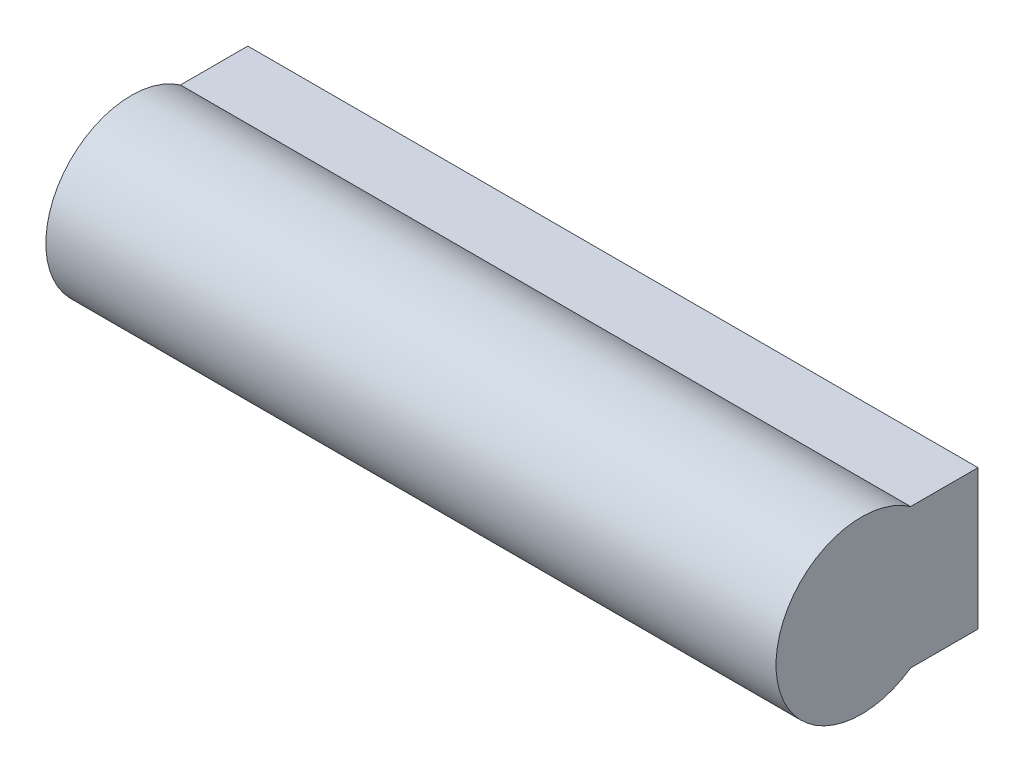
ISO-10303-21;
HEADER;
FILE_DESCRIPTION(('STEP AP214'),'2;1');
FILE_NAME('part.step','',(''),(''),'','','');
FILE_SCHEMA(('AUTOMOTIVE_DESIGN { 1 0 10303 214 1 1 1 1 }'));
ENDSEC;
DATA;
#1=APPLICATION_CONTEXT('core data for automotive mechanical design processes');
#2=APPLICATION_PROTOCOL_DEFINITION('international standard','automotive_design',2000,#1);
#3=PRODUCT_CONTEXT('',#1,'mechanical');
#4=PRODUCT('Part','Part','',(#3));
#5=PRODUCT_RELATED_PRODUCT_CATEGORY('part','',(#4));
#6=PRODUCT_DEFINITION_FORMATION('','',#4);
#7=PRODUCT_DEFINITION_CONTEXT('part definition',#1,'design');
#8=PRODUCT_DEFINITION('design','',#6,#7);
#9=PRODUCT_DEFINITION_SHAPE('','',#8);
#10=(LENGTH_UNIT() NAMED_UNIT(*) SI_UNIT(.MILLI.,.METRE.));
#11=(NAMED_UNIT(*) PLANE_ANGLE_UNIT() SI_UNIT($,.RADIAN.));
#12=(NAMED_UNIT(*) SI_UNIT($,.STERADIAN.) SOLID_ANGLE_UNIT());
#13=UNCERTAINTY_MEASURE_WITH_UNIT(LENGTH_MEASURE(1.E-05),#10,'distance_accuracy_value','');
#14=(GEOMETRIC_REPRESENTATION_CONTEXT(3) GLOBAL_UNCERTAINTY_ASSIGNED_CONTEXT((#13)) GLOBAL_UNIT_ASSIGNED_CONTEXT((#10,
#11,#12)) REPRESENTATION_CONTEXT('',''));
#15=CARTESIAN_POINT('',(0.,0.,0.));
#16=DIRECTION('',(0.,0.,1.));
#17=DIRECTION('',(1.,0.,0.));
#18=AXIS2_PLACEMENT_3D('',#15,#16,#17);
#19=CARTESIAN_POINT('',(37.5,0.,7.5));
#20=DIRECTION('',(-1.,0.,0.));
#21=DIRECTION('',(0.,0.,1.));
#22=AXIS2_PLACEMENT_3D('',#19,#20,#21);
#23=CYLINDRICAL_SURFACE('',#22,5.5);
#24=DIRECTION('',(-1.,0.,0.));
#25=VECTOR('',#24,1.);
#26=CARTESIAN_POINT('',(37.5,-4.5,4.33772233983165));
#27=LINE('',#26,#25);
#28=CARTESIAN_POINT('',(37.5,-4.5,4.33772233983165));
#29=VERTEX_POINT('',#28);
#30=CARTESIAN_POINT('',(-9.5,-4.5,4.33772233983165));
#31=VERTEX_POINT('',#30);
#32=EDGE_CURVE('E68',#29,#31,#27,.T.);
#33=ORIENTED_EDGE('',*,*,#32,.F.);
#34=CARTESIAN_POINT('',(37.5,0.,7.5));
#35=DIRECTION('',(1.,0.,0.));
#36=DIRECTION('',(0.,0.,-1.));
#37=AXIS2_PLACEMENT_3D('',#34,#35,#36);
#38=CIRCLE('',#37,5.5);
#39=CARTESIAN_POINT('',(37.5,4.5,4.33772233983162));
#40=VERTEX_POINT('',#39);
#41=EDGE_CURVE('E96',#40,#29,#38,.T.);
#42=ORIENTED_EDGE('',*,*,#41,.F.);
#43=DIRECTION('',(-1.,0.,0.));
#44=VECTOR('',#43,1.);
#45=CARTESIAN_POINT('',(37.5,4.5,4.33772233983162));
#46=LINE('',#45,#44);
#47=CARTESIAN_POINT('',(-9.5,4.5,4.33772233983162));
#48=VERTEX_POINT('',#47);
#49=EDGE_CURVE('E108',#40,#48,#46,.T.);
#50=ORIENTED_EDGE('',*,*,#49,.T.);
#51=CARTESIAN_POINT('',(-9.5,0.,7.5));
#52=DIRECTION('',(1.,0.,0.));
#53=DIRECTION('',(0.,0.,-1.));
#54=AXIS2_PLACEMENT_3D('',#51,#52,#53);
#55=CIRCLE('',#54,5.5);
#56=EDGE_CURVE('E79',#48,#31,#55,.T.);
#57=ORIENTED_EDGE('',*,*,#56,.T.);
#58=EDGE_LOOP('',(#33,#42,#50,#57));
#59=FACE_BOUND('',#58,.T.);
#60=ADVANCED_FACE('F14',(#59),#23,.T.);
#61=CARTESIAN_POINT('',(37.5,-4.5,4.33772233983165));
#62=DIRECTION('',(0.,1.,0.));
#63=DIRECTION('',(0.,0.,1.));
#64=AXIS2_PLACEMENT_3D('',#61,#62,#63);
#65=PLANE('',#64);
#66=DIRECTION('',(-1.,0.,0.));
#67=VECTOR('',#66,1.);
#68=CARTESIAN_POINT('',(37.5,-4.5,0.));
#69=LINE('',#68,#67);
#70=CARTESIAN_POINT('',(37.5,-4.5,0.));
#71=VERTEX_POINT('',#70);
#72=CARTESIAN_POINT('',(-9.5,-4.5,0.));
#73=VERTEX_POINT('',#72);
#74=EDGE_CURVE('E112',#71,#73,#69,.T.);
#75=ORIENTED_EDGE('',*,*,#74,.F.);
#76=DIRECTION('',(0.,0.,-1.));
#77=VECTOR('',#76,1.);
#78=CARTESIAN_POINT('',(37.5,-4.5,4.33772233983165));
#79=LINE('',#78,#77);
#80=EDGE_CURVE('E99',#29,#71,#79,.T.);
#81=ORIENTED_EDGE('',*,*,#80,.F.);
#82=ORIENTED_EDGE('',*,*,#32,.T.);
#83=DIRECTION('',(0.,0.,-1.));
#84=VECTOR('',#83,1.);
#85=CARTESIAN_POINT('',(-9.5,-4.5,4.33772233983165));
#86=LINE('',#85,#84);
#87=EDGE_CURVE('E87',#31,#73,#86,.T.);
#88=ORIENTED_EDGE('',*,*,#87,.T.);
#89=EDGE_LOOP('',(#75,#81,#82,#88));
#90=FACE_BOUND('',#89,.T.);
#91=ADVANCED_FACE('F16',(#90),#65,.F.);
#92=CARTESIAN_POINT('',(37.5,4.5,0.));
#93=DIRECTION('',(0.,0.,-1.));
#94=DIRECTION('',(0.,1.,0.));
#95=AXIS2_PLACEMENT_3D('',#92,#93,#94);
#96=PLANE('',#95);
#97=CARTESIAN_POINT('',(30.,0.,0.));
#98=DIRECTION('',(0.,0.,-1.));
#99=DIRECTION('',(0.,1.,0.));
#100=AXIS2_PLACEMENT_3D('',#97,#98,#99);
#101=CIRCLE('',#100,2.5);
#102=CARTESIAN_POINT('',(30.,2.5,0.));
#103=VERTEX_POINT('',#102);
#104=EDGE_CURVE('E81',#103,#103,#101,.T.);
#105=ORIENTED_EDGE('',*,*,#104,.F.);
#106=EDGE_LOOP('',(#105));
#107=FACE_BOUND('',#106,.T.);
#108=CARTESIAN_POINT('',(0.,0.,0.));
#109=DIRECTION('',(0.,0.,-1.));
#110=DIRECTION('',(0.,1.,0.));
#111=AXIS2_PLACEMENT_3D('',#108,#109,#110);
#112=CIRCLE('',#111,2.5);
#113=CARTESIAN_POINT('',(0.,2.5,0.));
#114=VERTEX_POINT('',#113);
#115=EDGE_CURVE('E76',#114,#114,#112,.T.);
#116=ORIENTED_EDGE('',*,*,#115,.F.);
#117=EDGE_LOOP('',(#116));
#118=FACE_BOUND('',#117,.T.);
#119=DIRECTION('',(-1.,0.,0.));
#120=VECTOR('',#119,1.);
#121=CARTESIAN_POINT('',(37.5,4.5,0.));
#122=LINE('',#121,#120);
#123=CARTESIAN_POINT('',(37.5,4.5,0.));
#124=VERTEX_POINT('',#123);
#125=CARTESIAN_POINT('',(-9.5,4.5,0.));
#126=VERTEX_POINT('',#125);
#127=EDGE_CURVE('E110',#124,#126,#122,.T.);
#128=ORIENTED_EDGE('',*,*,#127,.F.);
#129=DIRECTION('',(0.,-1.,0.));
#130=VECTOR('',#129,1.);
#131=CARTESIAN_POINT('',(37.5,4.5,0.));
#132=LINE('',#131,#130);
#133=EDGE_CURVE('E102',#124,#71,#132,.T.);
#134=ORIENTED_EDGE('',*,*,#133,.T.);
#135=ORIENTED_EDGE('',*,*,#74,.T.);
#136=DIRECTION('',(0.,-1.,0.));
#137=VECTOR('',#136,1.);
#138=CARTESIAN_POINT('',(-9.5,4.5,0.));
#139=LINE('',#138,#137);
#140=EDGE_CURVE('E90',#126,#73,#139,.T.);
#141=ORIENTED_EDGE('',*,*,#140,.F.);
#142=EDGE_LOOP('',(#128,#134,#135,#141));
#143=FACE_BOUND('',#142,.T.);
#144=ADVANCED_FACE('F125',(#107,#118,#143),#96,.T.);
#145=CARTESIAN_POINT('',(37.5,4.5,4.33772233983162));
#146=DIRECTION('',(0.,1.,0.));
#147=DIRECTION('',(1.,0.,0.));
#148=AXIS2_PLACEMENT_3D('',#145,#146,#147);
#149=PLANE('',#148);
#150=DIRECTION('',(0.,0.,-1.));
#151=VECTOR('',#150,1.);
#152=CARTESIAN_POINT('',(37.5,4.5,4.33772233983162));
#153=LINE('',#152,#151);
#154=EDGE_CURVE('E105',#40,#124,#153,.T.);
#155=ORIENTED_EDGE('',*,*,#154,.T.);
#156=ORIENTED_EDGE('',*,*,#127,.T.);
#157=DIRECTION('',(0.,0.,-1.));
#158=VECTOR('',#157,1.);
#159=CARTESIAN_POINT('',(-9.5,4.5,4.33772233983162));
#160=LINE('',#159,#158);
#161=EDGE_CURVE('E93',#48,#126,#160,.T.);
#162=ORIENTED_EDGE('',*,*,#161,.F.);
#163=ORIENTED_EDGE('',*,*,#49,.F.);
#164=EDGE_LOOP('',(#155,#156,#162,#163));
#165=FACE_BOUND('',#164,.T.);
#166=ADVANCED_FACE('F131',(#165),#149,.T.);
#167=CARTESIAN_POINT('',(37.5,0.,7.5));
#168=DIRECTION('',(1.,0.,0.));
#169=DIRECTION('',(0.,0.,-1.));
#170=AXIS2_PLACEMENT_3D('',#167,#168,#169);
#171=PLANE('',#170);
#172=ORIENTED_EDGE('',*,*,#41,.T.);
#173=ORIENTED_EDGE('',*,*,#80,.T.);
#174=ORIENTED_EDGE('',*,*,#133,.F.);
#175=ORIENTED_EDGE('',*,*,#154,.F.);
#176=EDGE_LOOP('',(#172,#173,#174,#175));
#177=FACE_BOUND('',#176,.T.);
#178=ADVANCED_FACE('F128',(#177),#171,.T.);
#179=CARTESIAN_POINT('',(-9.5,0.,7.5));
#180=DIRECTION('',(1.,0.,0.));
#181=DIRECTION('',(0.,0.,-1.));
#182=AXIS2_PLACEMENT_3D('',#179,#180,#181);
#183=PLANE('',#182);
#184=CARTESIAN_POINT('',(-9.5,0.,7.5));
#185=DIRECTION('',(-1.,0.,0.));
#186=DIRECTION('',(0.,0.,1.));
#187=AXIS2_PLACEMENT_3D('',#184,#185,#186);
#188=CIRCLE('',#187,4.);
#189=CARTESIAN_POINT('',(-9.5,0.,11.5));
#190=VERTEX_POINT('',#189);
#191=EDGE_CURVE('E202',#190,#190,#188,.T.);
#192=ORIENTED_EDGE('',*,*,#191,.F.);
#193=EDGE_LOOP('',(#192));
#194=FACE_BOUND('',#193,.T.);
#195=ORIENTED_EDGE('',*,*,#56,.F.);
#196=ORIENTED_EDGE('',*,*,#161,.T.);
#197=ORIENTED_EDGE('',*,*,#140,.T.);
#198=ORIENTED_EDGE('',*,*,#87,.F.);
#199=EDGE_LOOP('',(#195,#196,#197,#198));
#200=FACE_BOUND('',#199,.T.);
#201=ADVANCED_FACE('F122',(#194,#200),#183,.F.);
#202=CARTESIAN_POINT('',(0.,0.,11.));
#203=DIRECTION('',(0.,0.,-1.));
#204=DIRECTION('',(0.,1.,0.));
#205=AXIS2_PLACEMENT_3D('',#202,#203,#204);
#206=CYLINDRICAL_SURFACE('',#205,2.5);
#207=CARTESIAN_POINT('',(0.,2.5,4.37750100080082));
#208=CARTESIAN_POINT('',(-0.06215675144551,2.49999941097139,4.37750008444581));
#209=CARTESIAN_POINT('',(-0.12432594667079,2.49767581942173,4.37563509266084));
#210=CARTESIAN_POINT('',(-0.24811717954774,2.48843349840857,4.36827076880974));
#211=CARTESIAN_POINT('',(-0.3097388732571,2.48151206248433,4.36276929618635));
#212=CARTESIAN_POINT('',(-0.493226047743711,2.45397595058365,4.34111046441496));
#213=CARTESIAN_POINT('',(-0.61354833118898,2.42658990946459,4.31979963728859));
#214=CARTESIAN_POINT('',(-0.845598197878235,2.35576217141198,4.26700229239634));
#215=CARTESIAN_POINT('',(-0.957390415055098,2.31245961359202,4.23560424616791));
#216=CARTESIAN_POINT('',(-1.17200852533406,2.21143916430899,4.16633999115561));
#217=CARTESIAN_POINT('',(-1.27483417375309,2.15372087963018,4.12847360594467));
#218=CARTESIAN_POINT('',(-1.48373398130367,2.01647682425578,4.04440774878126));
#219=CARTESIAN_POINT('',(-1.58839332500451,1.93506425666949,3.99777185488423));
#220=CARTESIAN_POINT('',(-1.78376155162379,1.75662526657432,3.90494496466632));
#221=CARTESIAN_POINT('',(-1.87445827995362,1.65958538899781,3.85875438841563));
#222=CARTESIAN_POINT('',(-2.05022029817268,1.43833990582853,3.76540475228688));
#223=CARTESIAN_POINT('',(-2.13328618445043,1.31226934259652,3.71880112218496));
#224=CARTESIAN_POINT('',(-2.24054515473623,1.11163395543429,3.65692748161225));
#225=CARTESIAN_POINT('',(-2.27341513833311,1.04281240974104,3.63763716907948));
#226=CARTESIAN_POINT('',(-2.33295468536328,0.901758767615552,3.60229563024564));
#227=CARTESIAN_POINT('',(-2.35962853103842,0.829529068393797,3.58624216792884));
#228=CARTESIAN_POINT('',(-2.40398381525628,0.689700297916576,3.55933240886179));
#229=CARTESIAN_POINT('',(-2.42230197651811,0.62237198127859,3.54811464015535));
#230=CARTESIAN_POINT('',(-2.45330228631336,0.485997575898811,3.52903758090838));
#231=CARTESIAN_POINT('',(-2.46598768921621,0.416952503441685,3.52117635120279));
#232=CARTESIAN_POINT('',(-2.48551379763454,0.277765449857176,3.50904529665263));
#233=CARTESIAN_POINT('',(-2.49235811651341,0.207624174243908,3.50477325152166));
#234=CARTESIAN_POINT('',(-2.50009921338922,0.06691144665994,3.49993874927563));
#235=CARTESIAN_POINT('',(-2.50099667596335,-0.00365995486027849,3.49937586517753));
#236=CARTESIAN_POINT('',(-2.49527462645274,-0.196045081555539,3.50295520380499));
#237=CARTESIAN_POINT('',(-2.48269349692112,-0.317681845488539,3.51082959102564));
#238=CARTESIAN_POINT('',(-2.44026978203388,-0.556636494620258,3.53709096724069));
#239=CARTESIAN_POINT('',(-2.41042589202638,-0.673954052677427,3.55547875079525));
#240=CARTESIAN_POINT('',(-2.33479144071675,-0.901771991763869,3.60123829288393));
#241=CARTESIAN_POINT('',(-2.28896008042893,-1.01225407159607,3.62863302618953));
#242=CARTESIAN_POINT('',(-2.18306276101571,-1.22404012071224,3.69028708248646));
#243=CARTESIAN_POINT('',(-2.12299355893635,-1.32534199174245,3.72454796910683));
#244=CARTESIAN_POINT('',(-1.98194358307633,-1.52942649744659,3.80213558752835));
#245=CARTESIAN_POINT('',(-1.89929072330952,-1.63082454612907,3.84605993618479));
#246=CARTESIAN_POINT('',(-1.71973526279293,-1.81919733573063,3.93609072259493));
#247=CARTESIAN_POINT('',(-1.62281195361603,-1.90615071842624,3.98220026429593));
#248=CARTESIAN_POINT('',(-1.40258874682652,-2.07470887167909,4.07857116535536));
#249=CARTESIAN_POINT('',(-1.27749723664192,-2.15413229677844,4.12858837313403));
#250=CARTESIAN_POINT('',(-1.01270776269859,-2.29052307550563,4.21971721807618));
#251=CARTESIAN_POINT('',(-0.873037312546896,-2.34753179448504,4.26084519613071));
#252=CARTESIAN_POINT('',(-0.620461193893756,-2.42437133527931,4.31816246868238));
#253=CARTESIAN_POINT('',(-0.510178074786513,-2.45003683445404,4.33806591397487));
#254=CARTESIAN_POINT('',(-0.285769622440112,-2.48620337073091,4.36641722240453));
#255=CARTESIAN_POINT('',(-0.171649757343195,-2.49672512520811,4.37488073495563));
#256=CARTESIAN_POINT('',(0.0574573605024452,-2.5019707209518,4.37907732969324));
#257=CARTESIAN_POINT('',(0.17244600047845,-2.49665835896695,4.37478123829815));
#258=CARTESIAN_POINT('',(0.399561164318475,-2.47051466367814,4.35407914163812));
#259=CARTESIAN_POINT('',(0.511685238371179,-2.44967047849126,4.33766310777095));
#260=CARTESIAN_POINT('',(0.728436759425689,-2.39409874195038,4.29539879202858));
#261=CARTESIAN_POINT('',(0.83315731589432,-2.35960571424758,4.26971045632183));
#262=CARTESIAN_POINT('',(1.03557469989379,-2.27804893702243,4.21168851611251));
#263=CARTESIAN_POINT('',(1.13326901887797,-2.23098072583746,4.1793525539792));
#264=CARTESIAN_POINT('',(1.33861194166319,-2.11530798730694,4.10425598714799));
#265=CARTESIAN_POINT('',(1.44461452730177,-2.04430931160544,4.06068275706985));
#266=CARTESIAN_POINT('',(1.64437066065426,-1.8873786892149,3.97212056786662));
#267=CARTESIAN_POINT('',(1.73811132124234,-1.80143124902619,3.92713017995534));
#268=CARTESIAN_POINT('',(1.92596407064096,-1.60076932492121,3.83233790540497));
#269=CARTESIAN_POINT('',(2.0177273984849,-1.48365201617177,3.78292066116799));
#270=CARTESIAN_POINT('',(2.18014701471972,-1.2325678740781,3.69231026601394));
#271=CARTESIAN_POINT('',(2.25081319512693,-1.09860897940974,3.65111326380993));
#272=CARTESIAN_POINT('',(2.33658106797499,-0.89193080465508,3.60011033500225));
#273=CARTESIAN_POINT('',(2.36129744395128,-0.824318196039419,3.58522944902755));
#274=CARTESIAN_POINT('',(2.40493827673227,-0.686640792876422,3.55875356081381));
#275=CARTESIAN_POINT('',(2.42386608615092,-0.616577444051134,3.54715665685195));
#276=CARTESIAN_POINT('',(2.45560583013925,-0.474639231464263,3.5276148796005));
#277=CARTESIAN_POINT('',(2.46842309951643,-0.402766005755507,3.51966682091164));
#278=CARTESIAN_POINT('',(2.48773917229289,-0.25788180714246,3.50765831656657));
#279=CARTESIAN_POINT('',(2.49423902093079,-0.184871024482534,3.50359722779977));
#280=CARTESIAN_POINT('',(2.50307151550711,0.0131102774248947,3.49808478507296));
#281=CARTESIAN_POINT('',(2.49926579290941,0.138539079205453,3.50047293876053));
#282=CARTESIAN_POINT('',(2.47308241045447,0.386583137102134,3.51678024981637));
#283=CARTESIAN_POINT('',(2.45070559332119,0.509198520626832,3.53069888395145));
#284=CARTESIAN_POINT('',(2.38967758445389,0.744080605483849,3.56807916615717));
#285=CARTESIAN_POINT('',(2.35161792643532,0.856558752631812,3.59119298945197));
#286=CARTESIAN_POINT('',(2.26088053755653,1.07343034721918,3.64510028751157));
#287=CARTESIAN_POINT('',(2.20820034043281,1.17782242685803,3.67589505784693));
#288=CARTESIAN_POINT('',(2.08367872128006,1.38731297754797,3.74649326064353));
#289=CARTESIAN_POINT('',(2.01041600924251,1.4913601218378,3.78689998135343));
#290=CARTESIAN_POINT('',(1.84984676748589,1.68643334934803,3.87132716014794));
#291=CARTESIAN_POINT('',(1.76252439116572,1.77744451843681,3.91535166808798));
#292=CARTESIAN_POINT('',(1.56176748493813,1.95744716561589,4.00999171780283));
#293=CARTESIAN_POINT('',(1.44638338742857,2.04425661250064,4.06064261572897));
#294=CARTESIAN_POINT('',(1.20071059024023,2.19754648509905,4.15650352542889));
#295=CARTESIAN_POINT('',(1.07043018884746,2.26403815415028,4.20171653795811));
#296=CARTESIAN_POINT('',(0.827194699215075,2.36198229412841,4.2714046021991));
#297=CARTESIAN_POINT('',(0.716729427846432,2.3979245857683,4.29825360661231));
#298=CARTESIAN_POINT('',(0.490060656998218,2.45425618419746,4.34121641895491));
#299=CARTESIAN_POINT('',(0.373876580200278,2.47469472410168,4.35736418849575));
#300=CARTESIAN_POINT('',(0.213940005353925,2.49119847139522,4.37047142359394));
#301=CARTESIAN_POINT('',(0.171274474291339,2.49449433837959,4.3731000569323));
#302=CARTESIAN_POINT('',(0.0857413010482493,2.49889558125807,4.37661538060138));
#303=CARTESIAN_POINT('',(0.0428736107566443,2.50000040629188,4.3775016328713));
#304=CARTESIAN_POINT('',(0.,2.5,4.37750100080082));
#305=B_SPLINE_CURVE_WITH_KNOTS('',3,(#207,#208,#209,#210,#211,#212,#213,#214,#215,#216,#217,
#218,#219,#220,#221,#222,#223,#224,#225,#226,#227,#228,#229,#230,#231,#232,#233,#234,#235,#236,
#237,#238,#239,#240,#241,#242,#243,#244,#245,#246,#247,#248,#249,#250,#251,#252,#253,#254,#255,
#256,#257,#258,#259,#260,#261,#262,#263,#264,#265,#266,#267,#268,#269,#270,#271,#272,#273,#274,
#275,#276,#277,#278,#279,#280,#281,#282,#283,#284,#285,#286,#287,#288,#289,#290,#291,#292,#293,
#294,#295,#296,#297,#298,#299,#300,#301,#302,#303,#304),.UNSPECIFIED.,.T.,.F.,(4,2,2,2,2,2,2,2,
2,2,2,2,2,2,2,2,2,2,2,2,2,2,2,2,2,2,2,2,2,2,2,2,2,2,2,2,2,2,2,2,2,2,2,2,2,2,2,2,4),(0.,
0.186415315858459,0.372940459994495,0.746478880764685,1.11682668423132,1.48718459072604,
1.9072279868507,2.32763499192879,2.7987602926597,3.03445880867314,3.26999394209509,
3.48170145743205,3.69328649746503,3.90474055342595,4.11617026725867,4.48184709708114,
4.84755156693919,5.21419620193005,5.58092442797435,5.99329080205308,6.40626158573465,
6.87316206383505,7.33919680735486,7.68265621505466,8.02564530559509,8.36941921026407,
8.7134778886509,9.05186495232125,9.390372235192,9.79332737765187,10.1967026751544,
10.6647326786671,11.1325428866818,11.3527929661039,11.5729152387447,11.7928449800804,
12.0127383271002,12.3871595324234,12.7615637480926,13.1229788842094,13.4844550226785,
13.8834503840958,14.2828986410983,14.7399238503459,15.1966956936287,15.5530255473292,
15.9082190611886,16.0367696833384,16.1653526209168),.UNSPECIFIED.);
#306=CARTESIAN_POINT('',(0.,2.5,4.37750100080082));
#307=VERTEX_POINT('',#306);
#308=EDGE_CURVE('E174',#307,#307,#305,.T.);
#309=ORIENTED_EDGE('',*,*,#308,.T.);
#310=EDGE_LOOP('',(#309));
#311=FACE_BOUND('',#310,.T.);
#312=ORIENTED_EDGE('',*,*,#115,.T.);
#313=EDGE_LOOP('',(#312));
#314=FACE_BOUND('',#313,.T.);
#315=ADVANCED_FACE('F144',(#311,#314),#206,.F.);
#316=CARTESIAN_POINT('',(30.,0.,11.));
#317=DIRECTION('',(0.,0.,-1.));
#318=DIRECTION('',(0.,1.,0.));
#319=AXIS2_PLACEMENT_3D('',#316,#317,#318);
#320=CYLINDRICAL_SURFACE('',#319,2.5);
#321=CARTESIAN_POINT('',(30.,0.,6.));
#322=DIRECTION('',(0.,0.,-1.));
#323=DIRECTION('',(0.,1.,0.));
#324=AXIS2_PLACEMENT_3D('',#321,#322,#323);
#325=CIRCLE('',#324,2.5);
#326=CARTESIAN_POINT('',(30.,2.5,6.));
#327=VERTEX_POINT('',#326);
#328=EDGE_CURVE('E193',#327,#327,#325,.T.);
#329=ORIENTED_EDGE('',*,*,#328,.F.);
#330=EDGE_LOOP('',(#329));
#331=FACE_BOUND('',#330,.T.);
#332=ORIENTED_EDGE('',*,*,#104,.T.);
#333=EDGE_LOOP('',(#332));
#334=FACE_BOUND('',#333,.T.);
#335=ADVANCED_FACE('F156',(#331,#334),#320,.F.);
#336=CARTESIAN_POINT('',(13.5,0.,7.5));
#337=DIRECTION('',(-1.,0.,0.));
#338=DIRECTION('',(0.,0.,1.));
#339=AXIS2_PLACEMENT_3D('',#336,#337,#338);
#340=CYLINDRICAL_SURFACE('',#339,4.);
#341=DIRECTION('',(-1.,0.,0.));
#342=VECTOR('',#341,1.);
#343=CARTESIAN_POINT('',(13.5,-1.93649167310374,11.));
#344=LINE('',#343,#342);
#345=CARTESIAN_POINT('',(1.58113883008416,-1.93649167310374,11.));
#346=VERTEX_POINT('',#345);
#347=CARTESIAN_POINT('',(-1.58113883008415,-1.93649167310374,11.));
#348=VERTEX_POINT('',#347);
#349=EDGE_CURVE('E9',#346,#348,#344,.T.);
#350=ORIENTED_EDGE('',*,*,#349,.T.);
#351=CARTESIAN_POINT('',(1.58113883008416,-1.93649167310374,11.));
#352=CARTESIAN_POINT('',(1.53046718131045,-1.97785944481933,10.9771160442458));
#353=CARTESIAN_POINT('',(1.47813788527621,-2.01727674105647,10.9543449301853));
#354=CARTESIAN_POINT('',(1.37028287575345,-2.09204183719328,10.9095825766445));
#355=CARTESIAN_POINT('',(1.31475524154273,-2.12738715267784,10.8875918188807));
#356=CARTESIAN_POINT('',(1.20005218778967,-2.19415702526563,10.8447373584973));
#357=CARTESIAN_POINT('',(1.14084316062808,-2.22553378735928,10.8238888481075));
#358=CARTESIAN_POINT('',(1.01953031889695,-2.28365532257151,10.784228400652));
#359=CARTESIAN_POINT('',(0.957426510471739,-2.31040010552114,10.7654164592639));
#360=CARTESIAN_POINT('',(0.8301541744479,-2.35913471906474,10.7303856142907));
#361=CARTESIAN_POINT('',(0.764968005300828,-2.38109172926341,10.7141847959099));
#362=CARTESIAN_POINT('',(0.632328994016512,-2.41969582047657,10.6852244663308));
#363=CARTESIAN_POINT('',(0.564877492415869,-2.43634598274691,10.672462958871));
#364=CARTESIAN_POINT('',(0.428537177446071,-2.46397313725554,10.6510544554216));
#365=CARTESIAN_POINT('',(0.359657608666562,-2.47497904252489,10.6423865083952));
#366=CARTESIAN_POINT('',(0.220835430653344,-2.49120941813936,10.629532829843));
#367=CARTESIAN_POINT('',(0.150893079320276,-2.4964352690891,10.6253460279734));
#368=CARTESIAN_POINT('',(-0.0383328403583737,-2.50253285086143,10.6204818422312));
#369=CARTESIAN_POINT('',(-0.157990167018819,-2.49782171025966,10.6242919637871));
#370=CARTESIAN_POINT('',(-0.394341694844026,-2.47157761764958,10.6450836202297));
#371=CARTESIAN_POINT('',(-0.511030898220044,-2.45001801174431,10.6620860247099));
#372=CARTESIAN_POINT('',(-0.731962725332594,-2.39301886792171,10.7054095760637));
#373=CARTESIAN_POINT('',(-0.836536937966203,-2.35840744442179,10.7311671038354));
#374=CARTESIAN_POINT('',(-1.03865574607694,-2.27663866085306,10.7892889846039));
#375=CARTESIAN_POINT('',(-1.13620010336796,-2.2294808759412,10.8216535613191));
#376=CARTESIAN_POINT('',(-1.29204175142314,-2.14143713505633,10.8787582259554));
#377=CARTESIAN_POINT('',(-1.35256241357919,-2.10372051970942,10.9024325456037));
#378=CARTESIAN_POINT('',(-1.46973317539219,-2.02358462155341,10.9506946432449));
#379=CARTESIAN_POINT('',(-1.52639409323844,-1.98117943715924,10.9752795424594));
#380=CARTESIAN_POINT('',(-1.58113883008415,-1.93649167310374,11.));
#381=B_SPLINE_CURVE_WITH_KNOTS('',3,(#351,#352,#353,#354,#355,#356,#357,#358,#359,#360,#361,
#362,#363,#364,#365,#366,#367,#368,#369,#370,#371,#372,#373,#374,#375,#376,#377,#378,#379,#380),
.UNSPECIFIED.,.F.,.F.,(4,2,2,2,2,2,2,2,2,2,2,2,2,2,4),(0.,0.207870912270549,0.415867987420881,
0.626170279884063,0.836472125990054,1.04817318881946,1.25975110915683,1.47023410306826,
1.68066681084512,2.03793891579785,2.39577736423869,2.73394570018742,3.07212548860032,
3.29730769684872,3.52183031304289),.UNSPECIFIED.);
#382=EDGE_CURVE('E34',#346,#348,#381,.T.);
#383=ORIENTED_EDGE('',*,*,#382,.F.);
#384=EDGE_LOOP('',(#350,#383));
#385=FACE_BOUND('',#384,.T.);
#386=ORIENTED_EDGE('',*,*,#191,.T.);
#387=EDGE_LOOP('',(#386));
#388=FACE_BOUND('',#387,.T.);
#389=CARTESIAN_POINT('',(13.5,0.,7.5));
#390=DIRECTION('',(-1.,0.,0.));
#391=DIRECTION('',(0.,0.,1.));
#392=AXIS2_PLACEMENT_3D('',#389,#390,#391);
#393=CIRCLE('',#392,4.);
#394=CARTESIAN_POINT('',(13.5,0.,11.5));
#395=VERTEX_POINT('',#394);
#396=EDGE_CURVE('E72',#395,#395,#393,.T.);
#397=ORIENTED_EDGE('',*,*,#396,.F.);
#398=EDGE_LOOP('',(#397));
#399=FACE_BOUND('',#398,.T.);
#400=DIRECTION('',(-1.,0.,0.));
#401=VECTOR('',#400,1.);
#402=CARTESIAN_POINT('',(13.5,1.93649167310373,11.));
#403=LINE('',#402,#401);
#404=CARTESIAN_POINT('',(-1.58113883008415,1.93649167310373,11.));
#405=VERTEX_POINT('',#404);
#406=CARTESIAN_POINT('',(1.58113883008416,1.93649167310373,11.));
#407=VERTEX_POINT('',#406);
#408=EDGE_CURVE('E22',#405,#407,#403,.F.);
#409=ORIENTED_EDGE('',*,*,#408,.T.);
#410=CARTESIAN_POINT('',(-1.58113883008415,1.93649167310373,11.));
#411=CARTESIAN_POINT('',(-1.53046718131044,1.97785944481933,10.9771160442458));
#412=CARTESIAN_POINT('',(-1.47813788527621,2.01727674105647,10.9543449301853));
#413=CARTESIAN_POINT('',(-1.37028287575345,2.09204183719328,10.9095825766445));
#414=CARTESIAN_POINT('',(-1.31475524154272,2.12738715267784,10.8875918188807));
#415=CARTESIAN_POINT('',(-1.20005218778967,2.19415702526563,10.8447373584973));
#416=CARTESIAN_POINT('',(-1.14084316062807,2.22553378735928,10.8238888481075));
#417=CARTESIAN_POINT('',(-1.01953031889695,2.28365532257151,10.784228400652));
#418=CARTESIAN_POINT('',(-0.957426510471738,2.31040010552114,10.7654164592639));
#419=CARTESIAN_POINT('',(-0.8301541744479,2.35913471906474,10.7303856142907));
#420=CARTESIAN_POINT('',(-0.764968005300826,2.38109172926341,10.7141847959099));
#421=CARTESIAN_POINT('',(-0.632328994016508,2.41969582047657,10.6852244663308));
#422=CARTESIAN_POINT('',(-0.564877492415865,2.43634598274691,10.672462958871));
#423=CARTESIAN_POINT('',(-0.428537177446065,2.46397313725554,10.6510544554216));
#424=CARTESIAN_POINT('',(-0.359657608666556,2.47497904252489,10.6423865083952));
#425=CARTESIAN_POINT('',(-0.220835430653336,2.49120941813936,10.629532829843));
#426=CARTESIAN_POINT('',(-0.150893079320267,2.4964352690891,10.6253460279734));
#427=CARTESIAN_POINT('',(0.0383328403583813,2.50253285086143,10.6204818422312));
#428=CARTESIAN_POINT('',(0.157990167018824,2.49782171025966,10.6242919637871));
#429=CARTESIAN_POINT('',(0.394341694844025,2.47157761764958,10.6450836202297));
#430=CARTESIAN_POINT('',(0.511030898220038,2.4500180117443,10.6620860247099));
#431=CARTESIAN_POINT('',(0.731962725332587,2.39301886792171,10.7054095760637));
#432=CARTESIAN_POINT('',(0.836536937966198,2.35840744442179,10.7311671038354));
#433=CARTESIAN_POINT('',(1.03865574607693,2.27663866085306,10.7892889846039));
#434=CARTESIAN_POINT('',(1.13620010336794,2.2294808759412,10.8216535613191));
#435=CARTESIAN_POINT('',(1.29204175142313,2.14143713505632,10.8787582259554));
#436=CARTESIAN_POINT('',(1.35256241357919,2.10372051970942,10.9024325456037));
#437=CARTESIAN_POINT('',(1.4697331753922,2.02358462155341,10.9506946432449));
#438=CARTESIAN_POINT('',(1.52639409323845,1.98117943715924,10.9752795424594));
#439=CARTESIAN_POINT('',(1.58113883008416,1.93649167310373,11.));
#440=B_SPLINE_CURVE_WITH_KNOTS('',3,(#410,#411,#412,#413,#414,#415,#416,#417,#418,#419,#420,
#421,#422,#423,#424,#425,#426,#427,#428,#429,#430,#431,#432,#433,#434,#435,#436,#437,#438,#439),
.UNSPECIFIED.,.F.,.F.,(4,2,2,2,2,2,2,2,2,2,2,2,2,2,4),(0.,0.207870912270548,0.415867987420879,
0.626170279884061,0.836472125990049,1.04817318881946,1.25975110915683,1.47023410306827,
1.68066681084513,2.03793891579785,2.39577736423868,2.7339457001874,3.0721254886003,
3.29730769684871,3.5218303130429),.UNSPECIFIED.);
#441=EDGE_CURVE('E28',#405,#407,#440,.T.);
#442=ORIENTED_EDGE('',*,*,#441,.F.);
#443=EDGE_LOOP('',(#409,#442));
#444=FACE_BOUND('',#443,.T.);
#445=ORIENTED_EDGE('',*,*,#308,.F.);
#446=EDGE_LOOP('',(#445));
#447=FACE_BOUND('',#446,.T.);
#448=ADVANCED_FACE('F63',(#385,#388,#399,#444,#447),#340,.F.);
#449=CARTESIAN_POINT('',(13.5,0.,7.5));
#450=DIRECTION('',(-1.,0.,0.));
#451=DIRECTION('',(0.,0.,1.));
#452=AXIS2_PLACEMENT_3D('',#449,#450,#451);
#453=PLANE('',#452);
#454=ORIENTED_EDGE('',*,*,#396,.T.);
#455=EDGE_LOOP('',(#454));
#456=FACE_BOUND('',#455,.T.);
#457=ADVANCED_FACE('F181',(#456),#453,.T.);
#458=CARTESIAN_POINT('',(0.,0.,11.));
#459=DIRECTION('',(0.,0.,-1.));
#460=DIRECTION('',(0.,1.,0.));
#461=AXIS2_PLACEMENT_3D('',#458,#459,#460);
#462=PLANE('',#461);
#463=ORIENTED_EDGE('',*,*,#349,.F.);
#464=CARTESIAN_POINT('',(0.,0.,11.));
#465=DIRECTION('',(0.,0.,-1.));
#466=DIRECTION('',(0.,1.,0.));
#467=AXIS2_PLACEMENT_3D('',#464,#465,#466);
#468=CIRCLE('',#467,2.5);
#469=EDGE_CURVE('E75',#346,#348,#468,.T.);
#470=ORIENTED_EDGE('',*,*,#469,.T.);
#471=EDGE_LOOP('',(#463,#470));
#472=FACE_BOUND('',#471,.T.);
#473=ADVANCED_FACE('F211',(#472),#462,.T.);
#474=ORIENTED_EDGE('',*,*,#469,.F.);
#475=ORIENTED_EDGE('',*,*,#382,.T.);
#476=EDGE_LOOP('',(#474,#475));
#477=FACE_BOUND('',#476,.T.);
#478=ADVANCED_FACE('F158',(#477),#206,.F.);
#479=ORIENTED_EDGE('',*,*,#408,.F.);
#480=EDGE_CURVE('E71',#405,#407,#468,.T.);
#481=ORIENTED_EDGE('',*,*,#480,.T.);
#482=EDGE_LOOP('',(#479,#481));
#483=FACE_BOUND('',#482,.T.);
#484=ADVANCED_FACE('F74',(#483),#462,.T.);
#485=ORIENTED_EDGE('',*,*,#480,.F.);
#486=ORIENTED_EDGE('',*,*,#441,.T.);
#487=EDGE_LOOP('',(#485,#486));
#488=FACE_BOUND('',#487,.T.);
#489=ADVANCED_FACE('F70',(#488),#206,.F.);
#490=CARTESIAN_POINT('',(30.,0.,6.));
#491=DIRECTION('',(0.,0.,-1.));
#492=DIRECTION('',(0.,1.,0.));
#493=AXIS2_PLACEMENT_3D('',#490,#491,#492);
#494=PLANE('',#493);
#495=ORIENTED_EDGE('',*,*,#328,.T.);
#496=EDGE_LOOP('',(#495));
#497=FACE_BOUND('',#496,.T.);
#498=ADVANCED_FACE('F227',(#497),#494,.T.);
#499=CLOSED_SHELL('',(#60,#91,#144,#166,#178,#201,#315,#335,#448,#457,#473,#478,#484,#489,#498));
#500=MANIFOLD_SOLID_BREP('B1',#499);
#501=ADVANCED_BREP_SHAPE_REPRESENTATION('',(#18,#500),#14);
#502=SHAPE_DEFINITION_REPRESENTATION(#9,#501);
ENDSEC;
END-ISO-10303-21;
